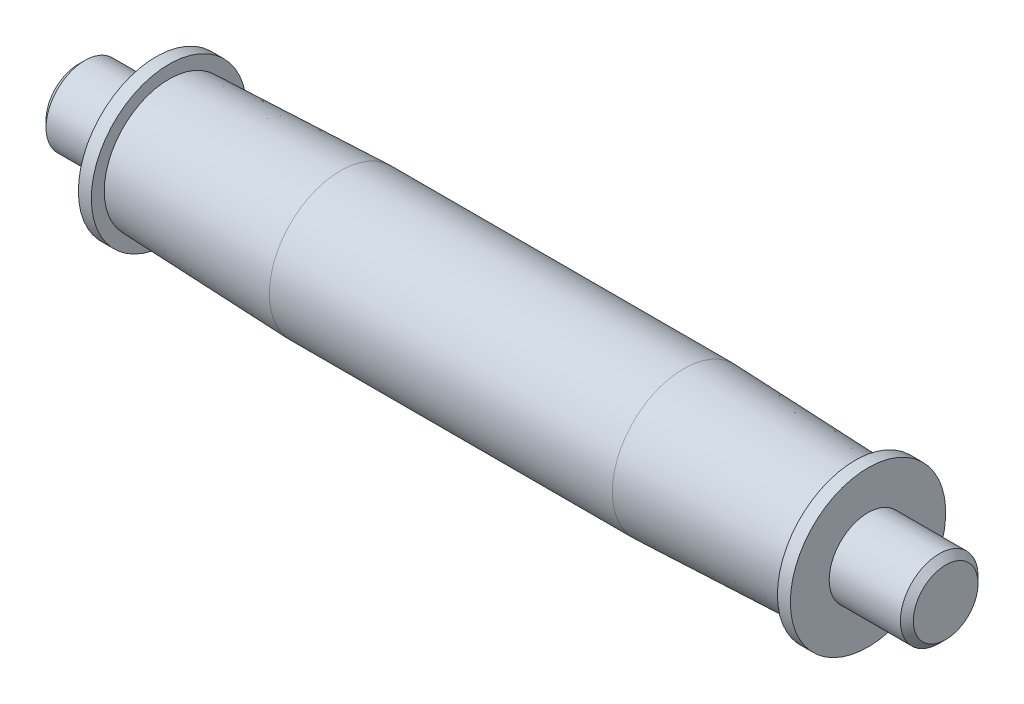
from build123d import *


with BuildPart() as part:
    # Croquis1 → Revoluci_n1 (revolve)
    with BuildSketch(Plane(origin=(0, 0, -300), x_dir=(-1, 0, 0), z_dir=(0, 0, -1)), mode=Mode.PRIVATE) as revoluci_n1_sk:
        Polygon((-15.223880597, -7.611940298), (-15.223880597, -13.95522388), (154.776119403, -13.95522388), (154.776119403, -7.611940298), (153.507462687, -6.343283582), (139.552238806, -6.343283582), (139.552238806, 1.268656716), (137.014925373, 1.268656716), (137.014925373, -1.268656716), (103.395522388, 0), (36.156716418, 0), (2.537313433, -1.268656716), (2.537313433, 1.268656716), (0, 1.268656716), (0, -6.343283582), (-13.955223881, -6.343283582), align=None)
    revolve(revoluci_n1_sk.sketch.rotate(Axis((15.223880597, -13.95522388, -300), (-1, 0, 0)), 270), axis=Axis((15.223880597, -13.95522388, -300), (-1, 0, 0)))


solid = part.part
